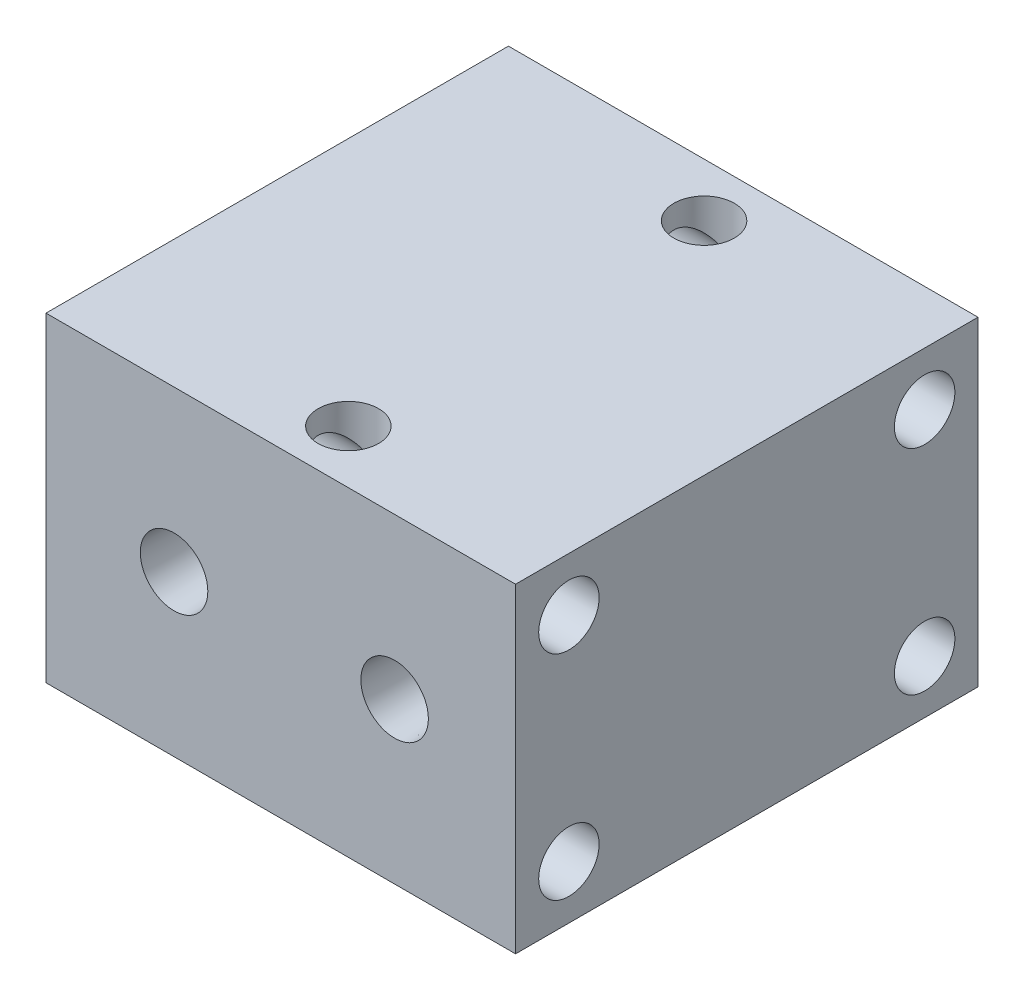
ISO-10303-21;
HEADER;
FILE_DESCRIPTION(('STEP AP214'),'2;1');
FILE_NAME('part.step','',(''),(''),'','','');
FILE_SCHEMA(('AUTOMOTIVE_DESIGN { 1 0 10303 214 1 1 1 1 }'));
ENDSEC;
DATA;
#1=APPLICATION_CONTEXT('core data for automotive mechanical design processes');
#2=APPLICATION_PROTOCOL_DEFINITION('international standard','automotive_design',2000,#1);
#3=PRODUCT_CONTEXT('',#1,'mechanical');
#4=PRODUCT('Part','Part','',(#3));
#5=PRODUCT_RELATED_PRODUCT_CATEGORY('part','',(#4));
#6=PRODUCT_DEFINITION_FORMATION('','',#4);
#7=PRODUCT_DEFINITION_CONTEXT('part definition',#1,'design');
#8=PRODUCT_DEFINITION('design','',#6,#7);
#9=PRODUCT_DEFINITION_SHAPE('','',#8);
#10=(LENGTH_UNIT() NAMED_UNIT(*) SI_UNIT(.MILLI.,.METRE.));
#11=(NAMED_UNIT(*) PLANE_ANGLE_UNIT() SI_UNIT($,.RADIAN.));
#12=(NAMED_UNIT(*) SI_UNIT($,.STERADIAN.) SOLID_ANGLE_UNIT());
#13=UNCERTAINTY_MEASURE_WITH_UNIT(LENGTH_MEASURE(1.E-05),#10,'distance_accuracy_value','');
#14=(GEOMETRIC_REPRESENTATION_CONTEXT(3) GLOBAL_UNCERTAINTY_ASSIGNED_CONTEXT((#13)) GLOBAL_UNIT_ASSIGNED_CONTEXT((#10,
#11,#12)) REPRESENTATION_CONTEXT('',''));
#15=CARTESIAN_POINT('',(0.,0.,0.));
#16=DIRECTION('',(0.,0.,1.));
#17=DIRECTION('',(1.,0.,0.));
#18=AXIS2_PLACEMENT_3D('',#15,#16,#17);
#19=CARTESIAN_POINT('',(2.00000000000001,45.,25.));
#20=DIRECTION('',(0.,-1.,0.));
#21=DIRECTION('',(0.,0.,-1.));
#22=AXIS2_PLACEMENT_3D('',#19,#20,#21);
#23=CYLINDRICAL_SURFACE('',#22,4.25);
#24=CARTESIAN_POINT('',(2.00000000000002,7.49999999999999,25.));
#25=DIRECTION('',(-0.707106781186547,-0.707106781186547,0.));
#26=DIRECTION('',(0.707106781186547,-0.707106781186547,0.));
#27=AXIS2_PLACEMENT_3D('',#24,#25,#26);
#28=ELLIPSE('',#27,6.01040764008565,4.25);
#29=CARTESIAN_POINT('',(2.00000000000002,7.49999999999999,20.75));
#30=VERTEX_POINT('',#29);
#31=CARTESIAN_POINT('',(2.00000000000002,7.49999999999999,29.25));
#32=VERTEX_POINT('',#31);
#33=EDGE_CURVE('E11',#30,#32,#28,.F.);
#34=ORIENTED_EDGE('',*,*,#33,.F.);
#35=CARTESIAN_POINT('',(2.00000000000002,7.49999999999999,25.));
#36=DIRECTION('',(0.707106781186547,-0.707106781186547,0.));
#37=DIRECTION('',(-0.707106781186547,-0.707106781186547,0.));
#38=AXIS2_PLACEMENT_3D('',#35,#36,#37);
#39=ELLIPSE('',#38,6.01040764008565,4.25);
#40=EDGE_CURVE('E47',#32,#30,#39,.F.);
#41=ORIENTED_EDGE('',*,*,#40,.F.);
#42=EDGE_LOOP('',(#34,#41));
#43=FACE_BOUND('',#42,.T.);
#44=CARTESIAN_POINT('',(2.00000000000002,37.5,25.));
#45=DIRECTION('',(-0.707106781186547,-0.707106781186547,0.));
#46=DIRECTION('',(0.707106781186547,-0.707106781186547,0.));
#47=AXIS2_PLACEMENT_3D('',#44,#45,#46);
#48=ELLIPSE('',#47,6.01040764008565,4.25);
#49=CARTESIAN_POINT('',(2.00000000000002,37.5,20.75));
#50=VERTEX_POINT('',#49);
#51=CARTESIAN_POINT('',(2.00000000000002,37.5,29.25));
#52=VERTEX_POINT('',#51);
#53=EDGE_CURVE('E116',#50,#52,#48,.T.);
#54=ORIENTED_EDGE('',*,*,#53,.F.);
#55=CARTESIAN_POINT('',(2.00000000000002,37.5,25.));
#56=DIRECTION('',(0.707106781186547,-0.707106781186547,0.));
#57=DIRECTION('',(-0.707106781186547,-0.707106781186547,0.));
#58=AXIS2_PLACEMENT_3D('',#55,#56,#57);
#59=ELLIPSE('',#58,6.01040764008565,4.25);
#60=EDGE_CURVE('E118',#52,#50,#59,.T.);
#61=ORIENTED_EDGE('',*,*,#60,.F.);
#62=EDGE_LOOP('',(#54,#61));
#63=FACE_BOUND('',#62,.T.);
#64=ADVANCED_FACE('F33',(#43,#63),#23,.F.);
#65=CARTESIAN_POINT('',(2.00000000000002,37.5,25.));
#66=DIRECTION('',(-0.707106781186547,-0.707106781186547,0.));
#67=DIRECTION('',(0.707106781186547,-0.707106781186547,0.));
#68=AXIS2_PLACEMENT_3D('',#65,#66,#67);
#69=ELLIPSE('',#68,6.01040764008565,4.25);
#70=EDGE_CURVE('E108',#50,#52,#69,.F.);
#71=ORIENTED_EDGE('',*,*,#70,.F.);
#72=CARTESIAN_POINT('',(2.00000000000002,37.5,25.));
#73=DIRECTION('',(0.707106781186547,-0.707106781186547,0.));
#74=DIRECTION('',(-0.707106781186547,-0.707106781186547,0.));
#75=AXIS2_PLACEMENT_3D('',#72,#73,#74);
#76=ELLIPSE('',#75,6.01040764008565,4.25);
#77=EDGE_CURVE('E54',#52,#50,#76,.F.);
#78=ORIENTED_EDGE('',*,*,#77,.F.);
#79=EDGE_LOOP('',(#71,#78));
#80=FACE_BOUND('',#79,.T.);
#81=CARTESIAN_POINT('',(2.00000000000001,45.,25.));
#82=DIRECTION('',(0.,1.,0.));
#83=DIRECTION('',(0.,0.,1.));
#84=AXIS2_PLACEMENT_3D('',#81,#82,#83);
#85=CIRCLE('',#84,4.25);
#86=CARTESIAN_POINT('',(2.00000000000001,45.,29.25));
#87=VERTEX_POINT('',#86);
#88=EDGE_CURVE('E186',#87,#87,#85,.T.);
#89=ORIENTED_EDGE('',*,*,#88,.T.);
#90=EDGE_LOOP('',(#89));
#91=FACE_BOUND('',#90,.T.);
#92=ADVANCED_FACE('F297',(#80,#91),#23,.F.);
#93=CARTESIAN_POINT('',(2.00000000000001,45.,-25.));
#94=DIRECTION('',(0.,-1.,0.));
#95=DIRECTION('',(0.,0.,-1.));
#96=AXIS2_PLACEMENT_3D('',#93,#94,#95);
#97=CYLINDRICAL_SURFACE('',#96,4.25);
#98=CARTESIAN_POINT('',(2.00000000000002,7.49999999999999,-25.));
#99=DIRECTION('',(-0.707106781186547,-0.707106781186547,0.));
#100=DIRECTION('',(0.707106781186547,-0.707106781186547,0.));
#101=AXIS2_PLACEMENT_3D('',#98,#99,#100);
#102=ELLIPSE('',#101,6.01040764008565,4.25);
#103=CARTESIAN_POINT('',(2.00000000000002,7.49999999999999,-29.25));
#104=VERTEX_POINT('',#103);
#105=CARTESIAN_POINT('',(2.00000000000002,7.49999999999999,-20.75));
#106=VERTEX_POINT('',#105);
#107=EDGE_CURVE('E121',#104,#106,#102,.F.);
#108=ORIENTED_EDGE('',*,*,#107,.F.);
#109=CARTESIAN_POINT('',(2.00000000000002,7.49999999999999,-25.));
#110=DIRECTION('',(0.707106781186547,-0.707106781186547,0.));
#111=DIRECTION('',(-0.707106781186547,-0.707106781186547,0.));
#112=AXIS2_PLACEMENT_3D('',#109,#110,#111);
#113=ELLIPSE('',#112,6.01040764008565,4.25);
#114=EDGE_CURVE('E129',#106,#104,#113,.F.);
#115=ORIENTED_EDGE('',*,*,#114,.F.);
#116=EDGE_LOOP('',(#108,#115));
#117=FACE_BOUND('',#116,.T.);
#118=CARTESIAN_POINT('',(2.00000000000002,37.5,-25.));
#119=DIRECTION('',(-0.707106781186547,-0.707106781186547,0.));
#120=DIRECTION('',(0.707106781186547,-0.707106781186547,0.));
#121=AXIS2_PLACEMENT_3D('',#118,#119,#120);
#122=ELLIPSE('',#121,6.01040764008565,4.25);
#123=CARTESIAN_POINT('',(2.00000000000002,37.5,-29.25));
#124=VERTEX_POINT('',#123);
#125=CARTESIAN_POINT('',(2.00000000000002,37.5,-20.75));
#126=VERTEX_POINT('',#125);
#127=EDGE_CURVE('E135',#124,#126,#122,.T.);
#128=ORIENTED_EDGE('',*,*,#127,.F.);
#129=CARTESIAN_POINT('',(2.00000000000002,37.5,-25.));
#130=DIRECTION('',(0.707106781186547,-0.707106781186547,0.));
#131=DIRECTION('',(-0.707106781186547,-0.707106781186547,0.));
#132=AXIS2_PLACEMENT_3D('',#129,#130,#131);
#133=ELLIPSE('',#132,6.01040764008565,4.25);
#134=EDGE_CURVE('E138',#126,#124,#133,.T.);
#135=ORIENTED_EDGE('',*,*,#134,.F.);
#136=EDGE_LOOP('',(#128,#135));
#137=FACE_BOUND('',#136,.T.);
#138=ADVANCED_FACE('F302',(#117,#137),#97,.F.);
#139=CARTESIAN_POINT('',(2.00000000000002,37.5,-25.));
#140=DIRECTION('',(-0.707106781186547,-0.707106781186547,0.));
#141=DIRECTION('',(0.707106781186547,-0.707106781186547,0.));
#142=AXIS2_PLACEMENT_3D('',#139,#140,#141);
#143=ELLIPSE('',#142,6.01040764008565,4.25);
#144=EDGE_CURVE('E132',#124,#126,#143,.F.);
#145=ORIENTED_EDGE('',*,*,#144,.F.);
#146=CARTESIAN_POINT('',(2.00000000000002,37.5,-25.));
#147=DIRECTION('',(0.707106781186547,-0.707106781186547,0.));
#148=DIRECTION('',(-0.707106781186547,-0.707106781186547,0.));
#149=AXIS2_PLACEMENT_3D('',#146,#147,#148);
#150=ELLIPSE('',#149,6.01040764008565,4.25);
#151=EDGE_CURVE('E140',#126,#124,#150,.F.);
#152=ORIENTED_EDGE('',*,*,#151,.F.);
#153=EDGE_LOOP('',(#145,#152));
#154=FACE_BOUND('',#153,.T.);
#155=CARTESIAN_POINT('',(2.00000000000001,45.,-25.));
#156=DIRECTION('',(0.,1.,0.));
#157=DIRECTION('',(0.,0.,1.));
#158=AXIS2_PLACEMENT_3D('',#155,#156,#157);
#159=CIRCLE('',#158,4.25);
#160=CARTESIAN_POINT('',(2.00000000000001,45.,-20.75));
#161=VERTEX_POINT('',#160);
#162=EDGE_CURVE('E175',#161,#161,#159,.T.);
#163=ORIENTED_EDGE('',*,*,#162,.T.);
#164=EDGE_LOOP('',(#163));
#165=FACE_BOUND('',#164,.T.);
#166=ADVANCED_FACE('F314',(#154,#165),#97,.F.);
#167=CARTESIAN_POINT('',(-33.,45.,32.5));
#168=DIRECTION('',(0.,1.,0.));
#169=DIRECTION('',(0.,0.,1.));
#170=AXIS2_PLACEMENT_3D('',#167,#168,#169);
#171=PLANE('',#170);
#172=ORIENTED_EDGE('',*,*,#162,.F.);
#173=EDGE_LOOP('',(#172));
#174=FACE_BOUND('',#173,.T.);
#175=DIRECTION('',(0.,0.,1.));
#176=VECTOR('',#175,1.);
#177=CARTESIAN_POINT('',(-33.,45.,-32.5));
#178=LINE('',#177,#176);
#179=CARTESIAN_POINT('',(-33.,45.,-32.5));
#180=VERTEX_POINT('',#179);
#181=CARTESIAN_POINT('',(-33.,45.,32.5));
#182=VERTEX_POINT('',#181);
#183=EDGE_CURVE('E167',#180,#182,#178,.T.);
#184=ORIENTED_EDGE('',*,*,#183,.T.);
#185=DIRECTION('',(1.,0.,0.));
#186=VECTOR('',#185,1.);
#187=CARTESIAN_POINT('',(-33.,45.,32.5));
#188=LINE('',#187,#186);
#189=CARTESIAN_POINT('',(33.,45.,32.5));
#190=VERTEX_POINT('',#189);
#191=EDGE_CURVE('E179',#182,#190,#188,.T.);
#192=ORIENTED_EDGE('',*,*,#191,.T.);
#193=DIRECTION('',(0.,0.,-1.));
#194=VECTOR('',#193,1.);
#195=CARTESIAN_POINT('',(33.,45.,-32.5));
#196=LINE('',#195,#194);
#197=CARTESIAN_POINT('',(33.,45.,-32.5));
#198=VERTEX_POINT('',#197);
#199=EDGE_CURVE('E177',#190,#198,#196,.T.);
#200=ORIENTED_EDGE('',*,*,#199,.T.);
#201=DIRECTION('',(-1.,0.,0.));
#202=VECTOR('',#201,1.);
#203=CARTESIAN_POINT('',(-33.,45.,-32.5));
#204=LINE('',#203,#202);
#205=EDGE_CURVE('E164',#198,#180,#204,.T.);
#206=ORIENTED_EDGE('',*,*,#205,.T.);
#207=EDGE_LOOP('',(#184,#192,#200,#206));
#208=FACE_BOUND('',#207,.T.);
#209=ORIENTED_EDGE('',*,*,#88,.F.);
#210=EDGE_LOOP('',(#209));
#211=FACE_BOUND('',#210,.T.);
#212=ADVANCED_FACE('F276',(#174,#208,#211),#171,.T.);
#213=CARTESIAN_POINT('',(-33.,0.,32.5));
#214=DIRECTION('',(0.,1.,0.));
#215=DIRECTION('',(0.,0.,1.));
#216=AXIS2_PLACEMENT_3D('',#213,#214,#215);
#217=PLANE('',#216);
#218=CARTESIAN_POINT('',(2.00000000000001,0.,-25.));
#219=DIRECTION('',(0.,1.,0.));
#220=DIRECTION('',(0.,0.,1.));
#221=AXIS2_PLACEMENT_3D('',#218,#219,#220);
#222=CIRCLE('',#221,4.25);
#223=CARTESIAN_POINT('',(2.00000000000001,0.,-20.75));
#224=VERTEX_POINT('',#223);
#225=EDGE_CURVE('E183',#224,#224,#222,.T.);
#226=ORIENTED_EDGE('',*,*,#225,.T.);
#227=EDGE_LOOP('',(#226));
#228=FACE_BOUND('',#227,.T.);
#229=DIRECTION('',(0.,0.,1.));
#230=VECTOR('',#229,1.);
#231=CARTESIAN_POINT('',(-33.,0.,-32.5));
#232=LINE('',#231,#230);
#233=CARTESIAN_POINT('',(-33.,0.,-32.5));
#234=VERTEX_POINT('',#233);
#235=CARTESIAN_POINT('',(-33.,0.,32.5));
#236=VERTEX_POINT('',#235);
#237=EDGE_CURVE('E172',#234,#236,#232,.T.);
#238=ORIENTED_EDGE('',*,*,#237,.F.);
#239=DIRECTION('',(-1.,0.,0.));
#240=VECTOR('',#239,1.);
#241=CARTESIAN_POINT('',(-33.,0.,-32.5));
#242=LINE('',#241,#240);
#243=CARTESIAN_POINT('',(33.,0.,-32.5));
#244=VERTEX_POINT('',#243);
#245=EDGE_CURVE('E165',#244,#234,#242,.T.);
#246=ORIENTED_EDGE('',*,*,#245,.F.);
#247=DIRECTION('',(0.,0.,-1.));
#248=VECTOR('',#247,1.);
#249=CARTESIAN_POINT('',(33.,0.,-32.5));
#250=LINE('',#249,#248);
#251=CARTESIAN_POINT('',(33.,0.,32.5));
#252=VERTEX_POINT('',#251);
#253=EDGE_CURVE('E168',#252,#244,#250,.T.);
#254=ORIENTED_EDGE('',*,*,#253,.F.);
#255=DIRECTION('',(1.,0.,0.));
#256=VECTOR('',#255,1.);
#257=CARTESIAN_POINT('',(-33.,0.,32.5));
#258=LINE('',#257,#256);
#259=EDGE_CURVE('E170',#236,#252,#258,.T.);
#260=ORIENTED_EDGE('',*,*,#259,.F.);
#261=EDGE_LOOP('',(#238,#246,#254,#260));
#262=FACE_BOUND('',#261,.T.);
#263=CARTESIAN_POINT('',(2.00000000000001,0.,25.));
#264=DIRECTION('',(0.,1.,0.));
#265=DIRECTION('',(0.,0.,1.));
#266=AXIS2_PLACEMENT_3D('',#263,#264,#265);
#267=CIRCLE('',#266,4.25);
#268=CARTESIAN_POINT('',(2.00000000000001,0.,29.25));
#269=VERTEX_POINT('',#268);
#270=EDGE_CURVE('E189',#269,#269,#267,.T.);
#271=ORIENTED_EDGE('',*,*,#270,.T.);
#272=EDGE_LOOP('',(#271));
#273=FACE_BOUND('',#272,.T.);
#274=ADVANCED_FACE('F255',(#228,#262,#273),#217,.F.);
#275=CARTESIAN_POINT('',(-33.,45.,-32.5));
#276=DIRECTION('',(1.,0.,0.));
#277=DIRECTION('',(0.,0.,-1.));
#278=AXIS2_PLACEMENT_3D('',#275,#276,#277);
#279=PLANE('',#278);
#280=CARTESIAN_POINT('',(-33.,7.5,25.));
#281=DIRECTION('',(-1.,0.,0.));
#282=DIRECTION('',(0.,0.,1.));
#283=AXIS2_PLACEMENT_3D('',#280,#281,#282);
#284=CIRCLE('',#283,4.25);
#285=CARTESIAN_POINT('',(-33.,7.5,29.25));
#286=VERTEX_POINT('',#285);
#287=EDGE_CURVE('E248',#286,#286,#284,.T.);
#288=ORIENTED_EDGE('',*,*,#287,.F.);
#289=EDGE_LOOP('',(#288));
#290=FACE_BOUND('',#289,.T.);
#291=CARTESIAN_POINT('',(-33.,37.5,25.));
#292=DIRECTION('',(-1.,0.,0.));
#293=DIRECTION('',(0.,0.,1.));
#294=AXIS2_PLACEMENT_3D('',#291,#292,#293);
#295=CIRCLE('',#294,4.25);
#296=CARTESIAN_POINT('',(-33.,37.5,29.25));
#297=VERTEX_POINT('',#296);
#298=EDGE_CURVE('E242',#297,#297,#295,.T.);
#299=ORIENTED_EDGE('',*,*,#298,.F.);
#300=EDGE_LOOP('',(#299));
#301=FACE_BOUND('',#300,.T.);
#302=CARTESIAN_POINT('',(-33.,7.5,-25.));
#303=DIRECTION('',(-1.,0.,0.));
#304=DIRECTION('',(0.,0.,1.));
#305=AXIS2_PLACEMENT_3D('',#302,#303,#304);
#306=CIRCLE('',#305,4.25);
#307=CARTESIAN_POINT('',(-33.,7.5,-20.75));
#308=VERTEX_POINT('',#307);
#309=EDGE_CURVE('E236',#308,#308,#306,.T.);
#310=ORIENTED_EDGE('',*,*,#309,.F.);
#311=EDGE_LOOP('',(#310));
#312=FACE_BOUND('',#311,.T.);
#313=CARTESIAN_POINT('',(-33.,37.5,-25.));
#314=DIRECTION('',(-1.,0.,0.));
#315=DIRECTION('',(0.,0.,1.));
#316=AXIS2_PLACEMENT_3D('',#313,#314,#315);
#317=CIRCLE('',#316,4.25);
#318=CARTESIAN_POINT('',(-33.,37.5,-20.75));
#319=VERTEX_POINT('',#318);
#320=EDGE_CURVE('E230',#319,#319,#317,.T.);
#321=ORIENTED_EDGE('',*,*,#320,.F.);
#322=EDGE_LOOP('',(#321));
#323=FACE_BOUND('',#322,.T.);
#324=CARTESIAN_POINT('',(-33.,22.5,0.));
#325=DIRECTION('',(-1.,0.,0.));
#326=DIRECTION('',(0.,0.,1.));
#327=AXIS2_PLACEMENT_3D('',#324,#325,#326);
#328=CIRCLE('',#327,0.5);
#329=CARTESIAN_POINT('',(-33.,22.5,0.5));
#330=VERTEX_POINT('',#329);
#331=EDGE_CURVE('E195',#330,#330,#328,.T.);
#332=ORIENTED_EDGE('',*,*,#331,.F.);
#333=EDGE_LOOP('',(#332));
#334=FACE_BOUND('',#333,.T.);
#335=ORIENTED_EDGE('',*,*,#237,.T.);
#336=DIRECTION('',(0.,-1.,0.));
#337=VECTOR('',#336,1.);
#338=CARTESIAN_POINT('',(-33.,45.,32.5));
#339=LINE('',#338,#337);
#340=EDGE_CURVE('E143',#182,#236,#339,.T.);
#341=ORIENTED_EDGE('',*,*,#340,.F.);
#342=ORIENTED_EDGE('',*,*,#183,.F.);
#343=DIRECTION('',(0.,-1.,0.));
#344=VECTOR('',#343,1.);
#345=CARTESIAN_POINT('',(-33.,45.,-32.5));
#346=LINE('',#345,#344);
#347=EDGE_CURVE('E161',#180,#234,#346,.T.);
#348=ORIENTED_EDGE('',*,*,#347,.T.);
#349=EDGE_LOOP('',(#335,#341,#342,#348));
#350=FACE_BOUND('',#349,.T.);
#351=ADVANCED_FACE('F35',(#290,#301,#312,#323,#334,#350),#279,.F.);
#352=CARTESIAN_POINT('',(-33.,45.,32.5));
#353=DIRECTION('',(0.,0.,-1.));
#354=DIRECTION('',(-1.,0.,0.));
#355=AXIS2_PLACEMENT_3D('',#352,#353,#354);
#356=PLANE('',#355);
#357=CARTESIAN_POINT('',(16.,22.5,32.5));
#358=DIRECTION('',(0.,0.,1.));
#359=DIRECTION('',(1.,0.,0.));
#360=AXIS2_PLACEMENT_3D('',#357,#358,#359);
#361=CIRCLE('',#360,4.744593);
#362=CARTESIAN_POINT('',(20.744593,22.5,32.5));
#363=VERTEX_POINT('',#362);
#364=EDGE_CURVE('E152',#363,#363,#361,.T.);
#365=ORIENTED_EDGE('',*,*,#364,.F.);
#366=EDGE_LOOP('',(#365));
#367=FACE_BOUND('',#366,.T.);
#368=CARTESIAN_POINT('',(-15.,22.5,32.5));
#369=DIRECTION('',(0.,0.,1.));
#370=DIRECTION('',(1.,0.,0.));
#371=AXIS2_PLACEMENT_3D('',#368,#369,#370);
#372=CIRCLE('',#371,4.744593);
#373=CARTESIAN_POINT('',(-10.255407,22.5,32.5));
#374=VERTEX_POINT('',#373);
#375=EDGE_CURVE('E209',#374,#374,#372,.T.);
#376=ORIENTED_EDGE('',*,*,#375,.F.);
#377=EDGE_LOOP('',(#376));
#378=FACE_BOUND('',#377,.T.);
#379=ORIENTED_EDGE('',*,*,#259,.T.);
#380=DIRECTION('',(0.,-1.,0.));
#381=VECTOR('',#380,1.);
#382=CARTESIAN_POINT('',(33.,45.,32.5));
#383=LINE('',#382,#381);
#384=EDGE_CURVE('E155',#190,#252,#383,.T.);
#385=ORIENTED_EDGE('',*,*,#384,.F.);
#386=ORIENTED_EDGE('',*,*,#191,.F.);
#387=ORIENTED_EDGE('',*,*,#340,.T.);
#388=EDGE_LOOP('',(#379,#385,#386,#387));
#389=FACE_BOUND('',#388,.T.);
#390=ADVANCED_FACE('F254',(#367,#378,#389),#356,.F.);
#391=CARTESIAN_POINT('',(33.,45.,-32.5));
#392=DIRECTION('',(-1.,0.,0.));
#393=DIRECTION('',(0.,0.,1.));
#394=AXIS2_PLACEMENT_3D('',#391,#392,#393);
#395=PLANE('',#394);
#396=CARTESIAN_POINT('',(33.,7.5,25.));
#397=DIRECTION('',(-1.,0.,0.));
#398=DIRECTION('',(0.,0.,1.));
#399=AXIS2_PLACEMENT_3D('',#396,#397,#398);
#400=CIRCLE('',#399,4.25);
#401=CARTESIAN_POINT('',(33.,7.5,29.25));
#402=VERTEX_POINT('',#401);
#403=EDGE_CURVE('E245',#402,#402,#400,.F.);
#404=ORIENTED_EDGE('',*,*,#403,.F.);
#405=EDGE_LOOP('',(#404));
#406=FACE_BOUND('',#405,.T.);
#407=CARTESIAN_POINT('',(33.,37.5,25.));
#408=DIRECTION('',(-1.,0.,0.));
#409=DIRECTION('',(0.,0.,1.));
#410=AXIS2_PLACEMENT_3D('',#407,#408,#409);
#411=CIRCLE('',#410,4.25);
#412=CARTESIAN_POINT('',(33.,37.5,29.25));
#413=VERTEX_POINT('',#412);
#414=EDGE_CURVE('E239',#413,#413,#411,.F.);
#415=ORIENTED_EDGE('',*,*,#414,.F.);
#416=EDGE_LOOP('',(#415));
#417=FACE_BOUND('',#416,.T.);
#418=CARTESIAN_POINT('',(33.,7.5,-25.));
#419=DIRECTION('',(-1.,0.,0.));
#420=DIRECTION('',(0.,0.,1.));
#421=AXIS2_PLACEMENT_3D('',#418,#419,#420);
#422=CIRCLE('',#421,4.25);
#423=CARTESIAN_POINT('',(33.,7.5,-20.75));
#424=VERTEX_POINT('',#423);
#425=EDGE_CURVE('E233',#424,#424,#422,.F.);
#426=ORIENTED_EDGE('',*,*,#425,.F.);
#427=EDGE_LOOP('',(#426));
#428=FACE_BOUND('',#427,.T.);
#429=CARTESIAN_POINT('',(33.,37.5,-25.));
#430=DIRECTION('',(-1.,0.,0.));
#431=DIRECTION('',(0.,0.,1.));
#432=AXIS2_PLACEMENT_3D('',#429,#430,#431);
#433=CIRCLE('',#432,4.25);
#434=CARTESIAN_POINT('',(33.,37.5,-20.75));
#435=VERTEX_POINT('',#434);
#436=EDGE_CURVE('E227',#435,#435,#433,.F.);
#437=ORIENTED_EDGE('',*,*,#436,.F.);
#438=EDGE_LOOP('',(#437));
#439=FACE_BOUND('',#438,.T.);
#440=ORIENTED_EDGE('',*,*,#253,.T.);
#441=DIRECTION('',(0.,-1.,0.));
#442=VECTOR('',#441,1.);
#443=CARTESIAN_POINT('',(33.,45.,-32.5));
#444=LINE('',#443,#442);
#445=EDGE_CURVE('E158',#198,#244,#444,.T.);
#446=ORIENTED_EDGE('',*,*,#445,.F.);
#447=ORIENTED_EDGE('',*,*,#199,.F.);
#448=ORIENTED_EDGE('',*,*,#384,.T.);
#449=EDGE_LOOP('',(#440,#446,#447,#448));
#450=FACE_BOUND('',#449,.T.);
#451=ADVANCED_FACE('F283',(#406,#417,#428,#439,#450),#395,.F.);
#452=CARTESIAN_POINT('',(-33.,45.,-32.5));
#453=DIRECTION('',(0.,0.,1.));
#454=DIRECTION('',(1.,0.,0.));
#455=AXIS2_PLACEMENT_3D('',#452,#453,#454);
#456=PLANE('',#455);
#457=ORIENTED_EDGE('',*,*,#245,.T.);
#458=ORIENTED_EDGE('',*,*,#347,.F.);
#459=ORIENTED_EDGE('',*,*,#205,.F.);
#460=ORIENTED_EDGE('',*,*,#445,.T.);
#461=EDGE_LOOP('',(#457,#458,#459,#460));
#462=FACE_BOUND('',#461,.T.);
#463=ADVANCED_FACE('F281',(#462),#456,.F.);
#464=CARTESIAN_POINT('',(2.00000000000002,7.49999999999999,-25.));
#465=DIRECTION('',(-0.707106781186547,-0.707106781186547,0.));
#466=DIRECTION('',(0.707106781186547,-0.707106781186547,0.));
#467=AXIS2_PLACEMENT_3D('',#464,#465,#466);
#468=ELLIPSE('',#467,6.01040764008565,4.25);
#469=EDGE_CURVE('E124',#104,#106,#468,.T.);
#470=ORIENTED_EDGE('',*,*,#469,.F.);
#471=CARTESIAN_POINT('',(2.00000000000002,7.49999999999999,-25.));
#472=DIRECTION('',(0.707106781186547,-0.707106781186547,0.));
#473=DIRECTION('',(-0.707106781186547,-0.707106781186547,0.));
#474=AXIS2_PLACEMENT_3D('',#471,#472,#473);
#475=ELLIPSE('',#474,6.01040764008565,4.25);
#476=EDGE_CURVE('E127',#106,#104,#475,.T.);
#477=ORIENTED_EDGE('',*,*,#476,.F.);
#478=EDGE_LOOP('',(#470,#477));
#479=FACE_BOUND('',#478,.T.);
#480=ORIENTED_EDGE('',*,*,#225,.F.);
#481=EDGE_LOOP('',(#480));
#482=FACE_BOUND('',#481,.T.);
#483=ADVANCED_FACE('F291',(#479,#482),#97,.F.);
#484=CARTESIAN_POINT('',(2.00000000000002,7.49999999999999,25.));
#485=DIRECTION('',(-0.707106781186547,-0.707106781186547,0.));
#486=DIRECTION('',(0.707106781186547,-0.707106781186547,0.));
#487=AXIS2_PLACEMENT_3D('',#484,#485,#486);
#488=ELLIPSE('',#487,6.01040764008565,4.25);
#489=EDGE_CURVE('E41',#30,#32,#488,.T.);
#490=ORIENTED_EDGE('',*,*,#489,.F.);
#491=CARTESIAN_POINT('',(2.00000000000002,7.49999999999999,25.));
#492=DIRECTION('',(0.707106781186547,-0.707106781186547,0.));
#493=DIRECTION('',(-0.707106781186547,-0.707106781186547,0.));
#494=AXIS2_PLACEMENT_3D('',#491,#492,#493);
#495=ELLIPSE('',#494,6.01040764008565,4.25);
#496=EDGE_CURVE('E99',#32,#30,#495,.T.);
#497=ORIENTED_EDGE('',*,*,#496,.F.);
#498=EDGE_LOOP('',(#490,#497));
#499=FACE_BOUND('',#498,.T.);
#500=ORIENTED_EDGE('',*,*,#270,.F.);
#501=EDGE_LOOP('',(#500));
#502=FACE_BOUND('',#501,.T.);
#503=ADVANCED_FACE('F111',(#499,#502),#23,.F.);
#504=CARTESIAN_POINT('',(27.,22.5,0.));
#505=DIRECTION('',(-1.,0.,0.));
#506=DIRECTION('',(0.,0.,1.));
#507=AXIS2_PLACEMENT_3D('',#504,#505,#506);
#508=CYLINDRICAL_SURFACE('',#507,0.5);
#509=CARTESIAN_POINT('',(27.,22.5,0.));
#510=DIRECTION('',(-1.,0.,0.));
#511=DIRECTION('',(0.,0.,1.));
#512=AXIS2_PLACEMENT_3D('',#509,#510,#511);
#513=CIRCLE('',#512,0.5);
#514=CARTESIAN_POINT('',(27.,22.5,0.499999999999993));
#515=VERTEX_POINT('',#514);
#516=EDGE_CURVE('E192',#515,#515,#513,.T.);
#517=ORIENTED_EDGE('',*,*,#516,.F.);
#518=EDGE_LOOP('',(#517));
#519=FACE_BOUND('',#518,.T.);
#520=ORIENTED_EDGE('',*,*,#331,.T.);
#521=EDGE_LOOP('',(#520));
#522=FACE_BOUND('',#521,.T.);
#523=ADVANCED_FACE('F306',(#519,#522),#508,.F.);
#524=CARTESIAN_POINT('',(27.,22.5,0.));
#525=DIRECTION('',(-1.,0.,0.));
#526=DIRECTION('',(0.,0.,1.));
#527=AXIS2_PLACEMENT_3D('',#524,#525,#526);
#528=PLANE('',#527);
#529=ORIENTED_EDGE('',*,*,#516,.T.);
#530=EDGE_LOOP('',(#529));
#531=FACE_BOUND('',#530,.T.);
#532=ADVANCED_FACE('F311',(#531),#528,.T.);
#533=CARTESIAN_POINT('',(-15.,22.5,20.88));
#534=DIRECTION('',(0.,0.,1.));
#535=DIRECTION('',(1.,0.,0.));
#536=AXIS2_PLACEMENT_3D('',#533,#534,#535);
#537=CONICAL_SURFACE('',#536,4.21640000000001,1.02974425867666);
#538=CARTESIAN_POINT('',(-15.,22.5,19.5482525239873));
#539=DIRECTION('',(0.,0.,1.));
#540=DIRECTION('',(1.,0.,0.));
#541=AXIS2_PLACEMENT_3D('',#538,#539,#540);
#542=CIRCLE('',#541,2.);
#543=CARTESIAN_POINT('',(-13.,22.5,19.5482525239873));
#544=VERTEX_POINT('',#543);
#545=EDGE_CURVE('E149',#544,#544,#542,.F.);
#546=ORIENTED_EDGE('',*,*,#545,.T.);
#547=EDGE_LOOP('',(#546));
#548=FACE_BOUND('',#547,.T.);
#549=CARTESIAN_POINT('',(-15.,22.5,20.88));
#550=DIRECTION('',(0.,0.,1.));
#551=DIRECTION('',(1.,0.,0.));
#552=AXIS2_PLACEMENT_3D('',#549,#550,#551);
#553=CIRCLE('',#552,4.21640000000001);
#554=CARTESIAN_POINT('',(-10.7836,22.5,20.88));
#555=VERTEX_POINT('',#554);
#556=EDGE_CURVE('E198',#555,#555,#553,.T.);
#557=ORIENTED_EDGE('',*,*,#556,.T.);
#558=EDGE_LOOP('',(#557));
#559=FACE_BOUND('',#558,.T.);
#560=ADVANCED_FACE('F394',(#548,#559),#537,.F.);
#561=CARTESIAN_POINT('',(-15.,22.5,32.5));
#562=DIRECTION('',(0.,0.,1.));
#563=DIRECTION('',(1.,0.,0.));
#564=AXIS2_PLACEMENT_3D('',#561,#562,#563);
#565=CYLINDRICAL_SURFACE('',#564,4.21640000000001);
#566=ORIENTED_EDGE('',*,*,#556,.F.);
#567=EDGE_LOOP('',(#566));
#568=FACE_BOUND('',#567,.T.);
#569=CARTESIAN_POINT('',(-15.,22.5,25.58));
#570=DIRECTION('',(0.,0.,1.));
#571=DIRECTION('',(1.,0.,0.));
#572=AXIS2_PLACEMENT_3D('',#569,#570,#571);
#573=CIRCLE('',#572,4.2164);
#574=CARTESIAN_POINT('',(-10.7836,22.5,25.58));
#575=VERTEX_POINT('',#574);
#576=EDGE_CURVE('E203',#575,#575,#573,.T.);
#577=ORIENTED_EDGE('',*,*,#576,.T.);
#578=EDGE_LOOP('',(#577));
#579=FACE_BOUND('',#578,.T.);
#580=ADVANCED_FACE('F390',(#568,#579),#565,.F.);
#581=CARTESIAN_POINT('',(-10.7836,22.5,25.58));
#582=DIRECTION('',(0.,0.,-1.));
#583=DIRECTION('',(-1.,0.,0.));
#584=AXIS2_PLACEMENT_3D('',#581,#582,#583);
#585=PLANE('',#584);
#586=ORIENTED_EDGE('',*,*,#576,.F.);
#587=EDGE_LOOP('',(#586));
#588=FACE_BOUND('',#587,.T.);
#589=CARTESIAN_POINT('',(-15.,22.5,25.58));
#590=DIRECTION('',(0.,0.,1.));
#591=DIRECTION('',(1.,0.,0.));
#592=AXIS2_PLACEMENT_3D('',#589,#590,#591);
#593=CIRCLE('',#592,4.53739893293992);
#594=CARTESIAN_POINT('',(-10.4626010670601,22.5,25.58));
#595=VERTEX_POINT('',#594);
#596=EDGE_CURVE('E206',#595,#595,#593,.T.);
#597=ORIENTED_EDGE('',*,*,#596,.T.);
#598=EDGE_LOOP('',(#597));
#599=FACE_BOUND('',#598,.T.);
#600=ADVANCED_FACE('F386',(#588,#599),#585,.F.);
#601=CARTESIAN_POINT('',(-15.,22.5,32.5));
#602=DIRECTION('',(0.,0.,1.));
#603=DIRECTION('',(1.,0.,0.));
#604=AXIS2_PLACEMENT_3D('',#601,#602,#603);
#605=CONICAL_SURFACE('',#604,4.744593,0.0299323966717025);
#606=ORIENTED_EDGE('',*,*,#596,.F.);
#607=EDGE_LOOP('',(#606));
#608=FACE_BOUND('',#607,.T.);
#609=ORIENTED_EDGE('',*,*,#375,.T.);
#610=EDGE_LOOP('',(#609));
#611=FACE_BOUND('',#610,.T.);
#612=ADVANCED_FACE('F382',(#608,#611),#605,.F.);
#613=CARTESIAN_POINT('',(16.,22.5,20.88));
#614=DIRECTION('',(0.,0.,1.));
#615=DIRECTION('',(1.,0.,0.));
#616=AXIS2_PLACEMENT_3D('',#613,#614,#615);
#617=CONICAL_SURFACE('',#616,4.21640000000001,1.02974425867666);
#618=CARTESIAN_POINT('',(16.,22.5,19.5482525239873));
#619=DIRECTION('',(0.,0.,1.));
#620=DIRECTION('',(1.,0.,0.));
#621=AXIS2_PLACEMENT_3D('',#618,#619,#620);
#622=CIRCLE('',#621,2.);
#623=CARTESIAN_POINT('',(18.,22.5,19.5482525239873));
#624=VERTEX_POINT('',#623);
#625=EDGE_CURVE('E144',#624,#624,#622,.F.);
#626=ORIENTED_EDGE('',*,*,#625,.T.);
#627=EDGE_LOOP('',(#626));
#628=FACE_BOUND('',#627,.T.);
#629=CARTESIAN_POINT('',(16.,22.5,20.88));
#630=DIRECTION('',(0.,0.,1.));
#631=DIRECTION('',(1.,0.,0.));
#632=AXIS2_PLACEMENT_3D('',#629,#630,#631);
#633=CIRCLE('',#632,4.21640000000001);
#634=CARTESIAN_POINT('',(20.2164,22.5,20.88));
#635=VERTEX_POINT('',#634);
#636=EDGE_CURVE('E212',#635,#635,#633,.T.);
#637=ORIENTED_EDGE('',*,*,#636,.T.);
#638=EDGE_LOOP('',(#637));
#639=FACE_BOUND('',#638,.T.);
#640=ADVANCED_FACE('F378',(#628,#639),#617,.F.);
#641=CARTESIAN_POINT('',(16.,22.5,32.5));
#642=DIRECTION('',(0.,0.,1.));
#643=DIRECTION('',(1.,0.,0.));
#644=AXIS2_PLACEMENT_3D('',#641,#642,#643);
#645=CYLINDRICAL_SURFACE('',#644,4.21640000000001);
#646=ORIENTED_EDGE('',*,*,#636,.F.);
#647=EDGE_LOOP('',(#646));
#648=FACE_BOUND('',#647,.T.);
#649=CARTESIAN_POINT('',(16.,22.5,25.58));
#650=DIRECTION('',(0.,0.,1.));
#651=DIRECTION('',(1.,0.,0.));
#652=AXIS2_PLACEMENT_3D('',#649,#650,#651);
#653=CIRCLE('',#652,4.2164);
#654=CARTESIAN_POINT('',(20.2164,22.5,25.58));
#655=VERTEX_POINT('',#654);
#656=EDGE_CURVE('E215',#655,#655,#653,.T.);
#657=ORIENTED_EDGE('',*,*,#656,.T.);
#658=EDGE_LOOP('',(#657));
#659=FACE_BOUND('',#658,.T.);
#660=ADVANCED_FACE('F374',(#648,#659),#645,.F.);
#661=CARTESIAN_POINT('',(20.2164,22.5,25.58));
#662=DIRECTION('',(0.,0.,-1.));
#663=DIRECTION('',(-1.,0.,0.));
#664=AXIS2_PLACEMENT_3D('',#661,#662,#663);
#665=PLANE('',#664);
#666=ORIENTED_EDGE('',*,*,#656,.F.);
#667=EDGE_LOOP('',(#666));
#668=FACE_BOUND('',#667,.T.);
#669=CARTESIAN_POINT('',(16.,22.5,25.58));
#670=DIRECTION('',(0.,0.,1.));
#671=DIRECTION('',(1.,0.,0.));
#672=AXIS2_PLACEMENT_3D('',#669,#670,#671);
#673=CIRCLE('',#672,4.53739893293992);
#674=CARTESIAN_POINT('',(20.5373989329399,22.5,25.58));
#675=VERTEX_POINT('',#674);
#676=EDGE_CURVE('E218',#675,#675,#673,.T.);
#677=ORIENTED_EDGE('',*,*,#676,.T.);
#678=EDGE_LOOP('',(#677));
#679=FACE_BOUND('',#678,.T.);
#680=ADVANCED_FACE('F370',(#668,#679),#665,.F.);
#681=CARTESIAN_POINT('',(16.,22.5,32.5));
#682=DIRECTION('',(0.,0.,1.));
#683=DIRECTION('',(1.,0.,0.));
#684=AXIS2_PLACEMENT_3D('',#681,#682,#683);
#685=CONICAL_SURFACE('',#684,4.744593,0.0299323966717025);
#686=ORIENTED_EDGE('',*,*,#676,.F.);
#687=EDGE_LOOP('',(#686));
#688=FACE_BOUND('',#687,.T.);
#689=ORIENTED_EDGE('',*,*,#364,.T.);
#690=EDGE_LOOP('',(#689));
#691=FACE_BOUND('',#690,.T.);
#692=ADVANCED_FACE('F366',(#688,#691),#685,.F.);
#693=CARTESIAN_POINT('',(-15.,22.5,12.5));
#694=DIRECTION('',(0.,0.,1.));
#695=DIRECTION('',(1.,0.,0.));
#696=AXIS2_PLACEMENT_3D('',#693,#694,#695);
#697=CYLINDRICAL_SURFACE('',#696,2.);
#698=CARTESIAN_POINT('',(-15.,22.5,12.5));
#699=DIRECTION('',(0.,0.,1.));
#700=DIRECTION('',(1.,0.,0.));
#701=AXIS2_PLACEMENT_3D('',#698,#699,#700);
#702=CIRCLE('',#701,2.);
#703=CARTESIAN_POINT('',(-13.,22.5,12.5));
#704=VERTEX_POINT('',#703);
#705=EDGE_CURVE('E147',#704,#704,#702,.T.);
#706=ORIENTED_EDGE('',*,*,#705,.F.);
#707=EDGE_LOOP('',(#706));
#708=FACE_BOUND('',#707,.T.);
#709=ORIENTED_EDGE('',*,*,#545,.F.);
#710=EDGE_LOOP('',(#709));
#711=FACE_BOUND('',#710,.T.);
#712=ADVANCED_FACE('F362',(#708,#711),#697,.F.);
#713=CARTESIAN_POINT('',(-15.,22.5,12.5));
#714=DIRECTION('',(0.,0.,1.));
#715=DIRECTION('',(1.,0.,0.));
#716=AXIS2_PLACEMENT_3D('',#713,#714,#715);
#717=PLANE('',#716);
#718=ORIENTED_EDGE('',*,*,#705,.T.);
#719=EDGE_LOOP('',(#718));
#720=FACE_BOUND('',#719,.T.);
#721=ADVANCED_FACE('F358',(#720),#717,.T.);
#722=CARTESIAN_POINT('',(16.,22.5,12.5));
#723=DIRECTION('',(0.,0.,1.));
#724=DIRECTION('',(1.,0.,0.));
#725=AXIS2_PLACEMENT_3D('',#722,#723,#724);
#726=CYLINDRICAL_SURFACE('',#725,2.);
#727=CARTESIAN_POINT('',(16.,22.5,12.5));
#728=DIRECTION('',(0.,0.,1.));
#729=DIRECTION('',(1.,0.,0.));
#730=AXIS2_PLACEMENT_3D('',#727,#728,#729);
#731=CIRCLE('',#730,2.);
#732=CARTESIAN_POINT('',(18.,22.5,12.5));
#733=VERTEX_POINT('',#732);
#734=EDGE_CURVE('E148',#733,#733,#731,.T.);
#735=ORIENTED_EDGE('',*,*,#734,.F.);
#736=EDGE_LOOP('',(#735));
#737=FACE_BOUND('',#736,.T.);
#738=ORIENTED_EDGE('',*,*,#625,.F.);
#739=EDGE_LOOP('',(#738));
#740=FACE_BOUND('',#739,.T.);
#741=ADVANCED_FACE('F349',(#737,#740),#726,.F.);
#742=CARTESIAN_POINT('',(16.,22.5,12.5));
#743=DIRECTION('',(0.,0.,1.));
#744=DIRECTION('',(1.,0.,0.));
#745=AXIS2_PLACEMENT_3D('',#742,#743,#744);
#746=PLANE('',#745);
#747=ORIENTED_EDGE('',*,*,#734,.T.);
#748=EDGE_LOOP('',(#747));
#749=FACE_BOUND('',#748,.T.);
#750=ADVANCED_FACE('F340',(#749),#746,.T.);
#751=CARTESIAN_POINT('',(45.0208152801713,37.5,-25.));
#752=DIRECTION('',(-1.,0.,0.));
#753=DIRECTION('',(0.,0.,1.));
#754=AXIS2_PLACEMENT_3D('',#751,#752,#753);
#755=CYLINDRICAL_SURFACE('',#754,4.25);
#756=ORIENTED_EDGE('',*,*,#127,.T.);
#757=ORIENTED_EDGE('',*,*,#151,.T.);
#758=EDGE_LOOP('',(#756,#757));
#759=FACE_BOUND('',#758,.T.);
#760=ORIENTED_EDGE('',*,*,#436,.T.);
#761=EDGE_LOOP('',(#760));
#762=FACE_BOUND('',#761,.T.);
#763=ADVANCED_FACE('F336',(#759,#762),#755,.F.);
#764=ORIENTED_EDGE('',*,*,#144,.T.);
#765=ORIENTED_EDGE('',*,*,#134,.T.);
#766=EDGE_LOOP('',(#764,#765));
#767=FACE_BOUND('',#766,.T.);
#768=ORIENTED_EDGE('',*,*,#320,.T.);
#769=EDGE_LOOP('',(#768));
#770=FACE_BOUND('',#769,.T.);
#771=ADVANCED_FACE('F339',(#767,#770),#755,.F.);
#772=CARTESIAN_POINT('',(45.0208152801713,7.5,-25.));
#773=DIRECTION('',(-1.,0.,0.));
#774=DIRECTION('',(0.,0.,1.));
#775=AXIS2_PLACEMENT_3D('',#772,#773,#774);
#776=CYLINDRICAL_SURFACE('',#775,4.25);
#777=ORIENTED_EDGE('',*,*,#469,.T.);
#778=ORIENTED_EDGE('',*,*,#114,.T.);
#779=EDGE_LOOP('',(#777,#778));
#780=FACE_BOUND('',#779,.T.);
#781=ORIENTED_EDGE('',*,*,#425,.T.);
#782=EDGE_LOOP('',(#781));
#783=FACE_BOUND('',#782,.T.);
#784=ADVANCED_FACE('F348',(#780,#783),#776,.F.);
#785=ORIENTED_EDGE('',*,*,#107,.T.);
#786=ORIENTED_EDGE('',*,*,#476,.T.);
#787=EDGE_LOOP('',(#785,#786));
#788=FACE_BOUND('',#787,.T.);
#789=ORIENTED_EDGE('',*,*,#309,.T.);
#790=EDGE_LOOP('',(#789));
#791=FACE_BOUND('',#790,.T.);
#792=ADVANCED_FACE('F353',(#788,#791),#776,.F.);
#793=CARTESIAN_POINT('',(45.0208152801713,37.5,25.));
#794=DIRECTION('',(-1.,0.,0.));
#795=DIRECTION('',(0.,0.,1.));
#796=AXIS2_PLACEMENT_3D('',#793,#794,#795);
#797=CYLINDRICAL_SURFACE('',#796,4.25);
#798=ORIENTED_EDGE('',*,*,#53,.T.);
#799=ORIENTED_EDGE('',*,*,#77,.T.);
#800=EDGE_LOOP('',(#798,#799));
#801=FACE_BOUND('',#800,.T.);
#802=ORIENTED_EDGE('',*,*,#414,.T.);
#803=EDGE_LOOP('',(#802));
#804=FACE_BOUND('',#803,.T.);
#805=ADVANCED_FACE('F530',(#801,#804),#797,.F.);
#806=ORIENTED_EDGE('',*,*,#70,.T.);
#807=ORIENTED_EDGE('',*,*,#60,.T.);
#808=EDGE_LOOP('',(#806,#807));
#809=FACE_BOUND('',#808,.T.);
#810=ORIENTED_EDGE('',*,*,#298,.T.);
#811=EDGE_LOOP('',(#810));
#812=FACE_BOUND('',#811,.T.);
#813=ADVANCED_FACE('F539',(#809,#812),#797,.F.);
#814=CARTESIAN_POINT('',(45.0208152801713,7.5,25.));
#815=DIRECTION('',(-1.,0.,0.));
#816=DIRECTION('',(0.,0.,1.));
#817=AXIS2_PLACEMENT_3D('',#814,#815,#816);
#818=CYLINDRICAL_SURFACE('',#817,4.25);
#819=ORIENTED_EDGE('',*,*,#489,.T.);
#820=ORIENTED_EDGE('',*,*,#40,.T.);
#821=EDGE_LOOP('',(#819,#820));
#822=FACE_BOUND('',#821,.T.);
#823=ORIENTED_EDGE('',*,*,#403,.T.);
#824=EDGE_LOOP('',(#823));
#825=FACE_BOUND('',#824,.T.);
#826=ADVANCED_FACE('F106',(#822,#825),#818,.F.);
#827=ORIENTED_EDGE('',*,*,#33,.T.);
#828=ORIENTED_EDGE('',*,*,#496,.T.);
#829=EDGE_LOOP('',(#827,#828));
#830=FACE_BOUND('',#829,.T.);
#831=ORIENTED_EDGE('',*,*,#287,.T.);
#832=EDGE_LOOP('',(#831));
#833=FACE_BOUND('',#832,.T.);
#834=ADVANCED_FACE('F100',(#830,#833),#818,.F.);
#835=CLOSED_SHELL('',(#64,#92,#138,#166,#212,#274,#351,#390,#451,#463,#483,#503,#523,#532,#560,
#580,#600,#612,#640,#660,#680,#692,#712,#721,#741,#750,#763,#771,#784,#792,#805,#813,#826,#834));
#836=MANIFOLD_SOLID_BREP('B2',#835);
#837=ADVANCED_BREP_SHAPE_REPRESENTATION('',(#18,#836),#14);
#838=SHAPE_DEFINITION_REPRESENTATION(#9,#837);
ENDSEC;
END-ISO-10303-21;
